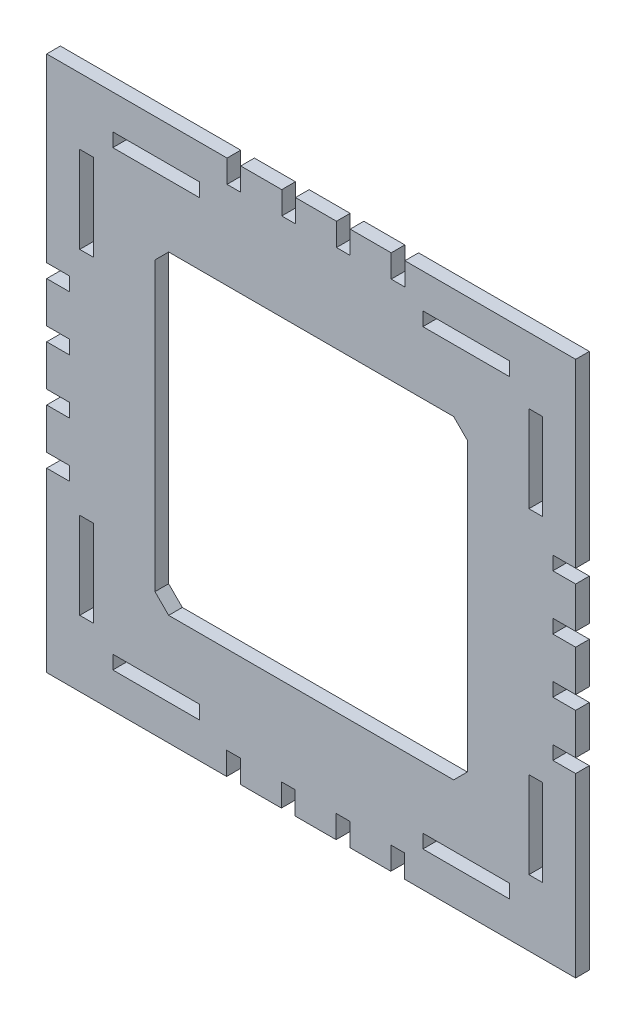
from build123d import *

# Parameters (mm, degrees)
SKETCH1_W           = 19
SKETCH1_H           = 3
SKETCH1_W_2         = 3
SKETCH1_H_2         = 19
BOSS_EXTRUDE1_DEPTH = 3


with BuildPart() as part:
    # Sketch1 → Boss-Extrude1 (new body)
    with BuildSketch(Plane.XY):
        Polygon((-58, -19.922714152), (-58, -58.75), (-18.533225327, -58.75), (-18.533225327, -53.75), (-15.533225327, -53.75), (-15.533225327, -58.75), (-6.533225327, -58.75), (-6.533225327, -53.75), (-3.533225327, -53.75), (-3.533225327, -58.75), (5.466774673, -58.75), (5.466774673, -53.75), (8.466774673, -53.75), (8.466774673, -58.75), (17.466774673, -58.75), (17.466774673, -53.75), (20.466774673, -53.75), (20.466774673, -58.75), (58, -58.75), (58, -19.922714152), (53, -19.922714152), (53, -16.922714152), (58, -16.922714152), (58, -15), (58, -12), (58, -7.922714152), (53, -7.922714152), (53, -4.922714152), (58, -4.922714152), (58, -3), (58, 0), (58, 4.077285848), (53, 4.077285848), (53, 7.077285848), (58, 7.077285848), (58, 16.077285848), (53, 16.077285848), (53, 19.077285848), (58, 19.077285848), (58, 58.75), (20.551899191, 58.75), (20.551899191, 53.75), (17.551899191, 53.75), (17.551899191, 58.75), (8.551899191, 58.75), (8.551899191, 53.75), (5.551899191, 53.75), (5.551899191, 58.75), (-3.448100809, 58.75), (-3.448100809, 53.75), (-6.448100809, 53.75), (-6.448100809, 58.75), (-15.448100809, 58.75), (-15.448100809, 53.75), (-18.448100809, 53.75), (-18.448100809, 58.75), (-58, 58.75), (-58, 19.077285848), (-53, 19.077285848), (-53, 16.077285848), (-58, 16.077285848), (-58, 7.077285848), (-53, 7.077285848), (-53, 4.077285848), (-58, 4.077285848), (-58, -4.922714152), (-53, -4.922714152), (-53, -7.922714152), (-58, -7.922714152), (-58, -16.922714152), (-53, -16.922714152), (-53, -19.922714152), align=None)
        with Locations((-34, -49.5)):
            Rectangle(SKETCH1_W, SKETCH1_H, mode=Mode.SUBTRACT)
        with Locations((-49.25, -34.75)):
            Rectangle(SKETCH1_W_2, SKETCH1_H_2, mode=Mode.SUBTRACT)
        with Locations((34, -49.5)):
            Rectangle(SKETCH1_W, SKETCH1_H, mode=Mode.SUBTRACT)
        with Locations((49.25, -34.75)):
            Rectangle(SKETCH1_W_2, SKETCH1_H_2, mode=Mode.SUBTRACT)
        Polygon((-34.25, 31.5), (-31.25, 34.5), (31.25, 34.5), (34.25, 31.5), (34.25, -31.5), (31.25, -34.5), (-31.25, -34.5), (-34.25, -31.5), align=None, mode=Mode.SUBTRACT)
        with Locations((-49.25, 34.75)):
            Rectangle(SKETCH1_W_2, SKETCH1_H_2, mode=Mode.SUBTRACT)
        with Locations((-34, 49.7)):
            Rectangle(SKETCH1_W, SKETCH1_H, mode=Mode.SUBTRACT)
        with Locations((49.25, 34.75)):
            Rectangle(SKETCH1_W_2, SKETCH1_H_2, mode=Mode.SUBTRACT)
        with Locations((34, 49.7)):
            Rectangle(SKETCH1_W, SKETCH1_H, mode=Mode.SUBTRACT)
    extrude(amount=BOSS_EXTRUDE1_DEPTH)


solid = part.part
